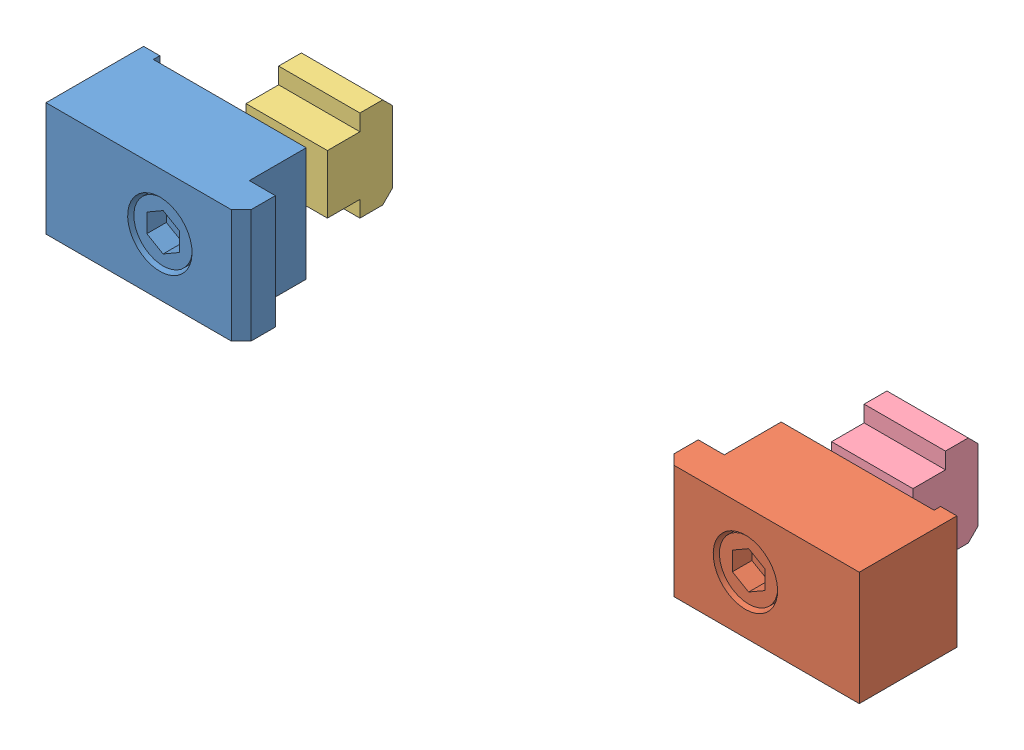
SolidWorks assembly MVAC150CS18.sldasm, configuration Default (file format 15000). Lengths in mm.
Overall size (250 35 59).
4 component instances, 4 part files, 0 mates.
Components (placement in the parent):
- MVAC150CS18_01-1: MVAC150CS18_01.sldprt [ﾃﾞﾌｫﾙﾄ] at origin size (60 35 53)
- MVAC150CS18_02-1: MVAC150CS18_02.sldprt [ﾃﾞﾌｫﾙﾄ] at (180 0 0) x (-1 0 0) z (0 0 1) size (60 35 53)
- MVAC150CS18_03-1: MVAC150CS18_03.sldprt [ﾃﾞﾌｫﾙﾄ] at (0 0 -19) size (25 28 20)
- MVAC150CS18_04-1: MVAC150CS18_04.sldprt [ﾃﾞﾌｫﾙﾄ] at (180 0 -19) size (25 28 20)
